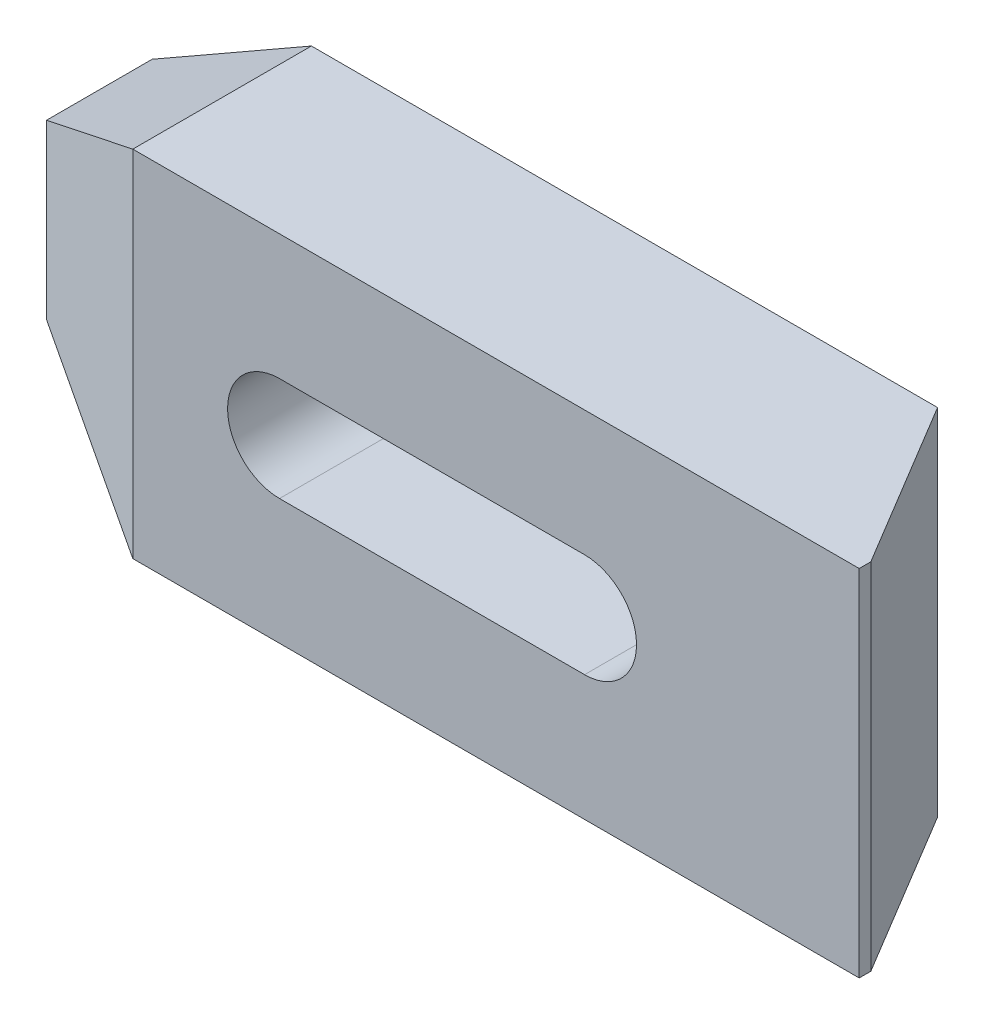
from build123d import *

# Parameters (mm, degrees)
BOSS_EXTRUDE1_DEPTH = 12.446
CHAMFER1_SIZE       = 5.08
CHAMFER1_SIZE2      = 11.0998
CUT_EXTRUDE1_DEPTH  = 108.964266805


with BuildPart() as part:
    # Sketch1 → Boss-Extrude1 (new body)
    with BuildSketch(Plane.XY):
        Polygon((53.73578153, 12.3571), (104.35798153, 12.3571), (104.35798153, -12.3571), (53.73578153, -12.3571), (42.63598153, -6.0071), (42.63598153, 6.0071), align=None)
        with BuildLine():
            Line((63.95928153, 3.6195), (85.21908153, 3.6195))
            ThreePointArc((85.21908153, 3.6195), (88.83858153, 0), (85.21908153, -3.6195))
            Line((85.21908153, -3.6195), (63.95928153, -3.6195))
            ThreePointArc((63.95928153, -3.6195), (60.33978153, 0), (63.95928153, 3.6195))
        make_face(mode=Mode.SUBTRACT)
    extrude(amount=BOSS_EXTRUDE1_DEPTH)

    # Chamfer1
    chamfer1_edges = [part.edges().sort_by_distance(p)[0] for p in [
        (42.63598153, 0, 12.446),
    ]]
    chamfer1_side = [part.faces().sort_by_distance(p)[0] for p in [
        (42.63598153, 0, 6.223),
    ]]
    chamfer(chamfer1_edges, length=CHAMFER1_SIZE, length2=CHAMFER1_SIZE2, reference=chamfer1_side[0])

    # Sketch2 → Cut-Extrude1 (cut, through all)
    with BuildSketch(Plane.XZ.offset(12.3571)):
        Polygon((104.35798153, 11.639144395), (97.37298153, 0), (97.37298153, -6.495173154), (107.440812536, -6.495173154), (107.440812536, 11.639144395), align=None)
    extrude(amount=-CUT_EXTRUDE1_DEPTH, mode=Mode.SUBTRACT)


solid = part.part
